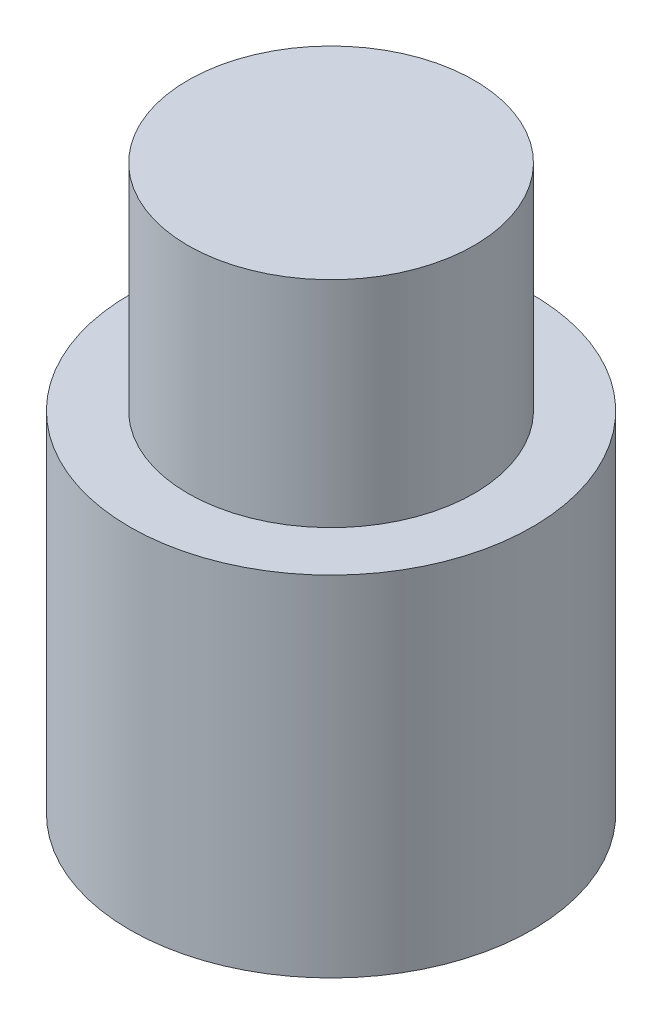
ISO-10303-21;
HEADER;
FILE_DESCRIPTION(('STEP AP214'),'2;1');
FILE_NAME('part.step','',(''),(''),'','','');
FILE_SCHEMA(('AUTOMOTIVE_DESIGN { 1 0 10303 214 1 1 1 1 }'));
ENDSEC;
DATA;
#1=APPLICATION_CONTEXT('core data for automotive mechanical design processes');
#2=APPLICATION_PROTOCOL_DEFINITION('international standard','automotive_design',2000,#1);
#3=PRODUCT_CONTEXT('',#1,'mechanical');
#4=PRODUCT('Part','Part','',(#3));
#5=PRODUCT_RELATED_PRODUCT_CATEGORY('part','',(#4));
#6=PRODUCT_DEFINITION_FORMATION('','',#4);
#7=PRODUCT_DEFINITION_CONTEXT('part definition',#1,'design');
#8=PRODUCT_DEFINITION('design','',#6,#7);
#9=PRODUCT_DEFINITION_SHAPE('','',#8);
#10=(LENGTH_UNIT() NAMED_UNIT(*) SI_UNIT(.MILLI.,.METRE.));
#11=(NAMED_UNIT(*) PLANE_ANGLE_UNIT() SI_UNIT($,.RADIAN.));
#12=(NAMED_UNIT(*) SI_UNIT($,.STERADIAN.) SOLID_ANGLE_UNIT());
#13=UNCERTAINTY_MEASURE_WITH_UNIT(LENGTH_MEASURE(1.E-05),#10,'distance_accuracy_value','');
#14=(GEOMETRIC_REPRESENTATION_CONTEXT(3) GLOBAL_UNCERTAINTY_ASSIGNED_CONTEXT((#13)) GLOBAL_UNIT_ASSIGNED_CONTEXT((#10,
#11,#12)) REPRESENTATION_CONTEXT('',''));
#15=CARTESIAN_POINT('',(0.,0.,0.));
#16=DIRECTION('',(0.,0.,1.));
#17=DIRECTION('',(1.,0.,0.));
#18=AXIS2_PLACEMENT_3D('',#15,#16,#17);
#19=CARTESIAN_POINT('',(0.,400.05,-203.2));
#20=DIRECTION('',(0.,-1.,0.));
#21=DIRECTION('',(0.,0.,-1.));
#22=AXIS2_PLACEMENT_3D('',#19,#20,#21);
#23=PLANE('',#22);
#24=CARTESIAN_POINT('',(0.,400.05,0.));
#25=DIRECTION('',(0.,1.,0.));
#26=DIRECTION('',(0.,0.,1.));
#27=AXIS2_PLACEMENT_3D('',#24,#25,#26);
#28=CIRCLE('',#27,203.2);
#29=CARTESIAN_POINT('',(0.,400.05,203.2));
#30=VERTEX_POINT('',#29);
#31=EDGE_CURVE('E10',#30,#30,#28,.T.);
#32=ORIENTED_EDGE('',*,*,#31,.T.);
#33=EDGE_LOOP('',(#32));
#34=FACE_BOUND('',#33,.T.);
#35=ADVANCED_FACE('F31',(#34),#23,.F.);
#36=CARTESIAN_POINT('',(0.,345.622216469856,0.));
#37=DIRECTION('',(0.,1.,0.));
#38=DIRECTION('',(0.,0.,1.));
#39=AXIS2_PLACEMENT_3D('',#36,#37,#38);
#40=CYLINDRICAL_SURFACE('',#39,203.2);
#41=ORIENTED_EDGE('',*,*,#31,.F.);
#42=EDGE_LOOP('',(#41));
#43=FACE_BOUND('',#42,.T.);
#44=CARTESIAN_POINT('',(0.,95.2499999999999,0.));
#45=DIRECTION('',(0.,1.,0.));
#46=DIRECTION('',(0.,0.,1.));
#47=AXIS2_PLACEMENT_3D('',#44,#45,#46);
#48=CIRCLE('',#47,203.2);
#49=CARTESIAN_POINT('',(0.,95.2499999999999,203.2));
#50=VERTEX_POINT('',#49);
#51=EDGE_CURVE('E37',#50,#50,#48,.T.);
#52=ORIENTED_EDGE('',*,*,#51,.T.);
#53=EDGE_LOOP('',(#52));
#54=FACE_BOUND('',#53,.T.);
#55=ADVANCED_FACE('F63',(#43,#54),#40,.T.);
#56=CARTESIAN_POINT('',(0.,95.2499999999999,-285.75));
#57=DIRECTION('',(0.,-1.,0.));
#58=DIRECTION('',(0.,0.,-1.));
#59=AXIS2_PLACEMENT_3D('',#56,#57,#58);
#60=PLANE('',#59);
#61=ORIENTED_EDGE('',*,*,#51,.F.);
#62=EDGE_LOOP('',(#61));
#63=FACE_BOUND('',#62,.T.);
#64=CARTESIAN_POINT('',(0.,95.2499999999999,0.));
#65=DIRECTION('',(0.,1.,0.));
#66=DIRECTION('',(0.,0.,1.));
#67=AXIS2_PLACEMENT_3D('',#64,#65,#66);
#68=CIRCLE('',#67,285.75);
#69=CARTESIAN_POINT('',(0.,95.2499999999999,285.75));
#70=VERTEX_POINT('',#69);
#71=EDGE_CURVE('E41',#70,#70,#68,.T.);
#72=ORIENTED_EDGE('',*,*,#71,.T.);
#73=EDGE_LOOP('',(#72));
#74=FACE_BOUND('',#73,.T.);
#75=ADVANCED_FACE('F59',(#63,#74),#60,.F.);
#76=CARTESIAN_POINT('',(0.,345.622216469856,0.));
#77=DIRECTION('',(0.,1.,0.));
#78=DIRECTION('',(0.,0.,1.));
#79=AXIS2_PLACEMENT_3D('',#76,#77,#78);
#80=CYLINDRICAL_SURFACE('',#79,285.75);
#81=ORIENTED_EDGE('',*,*,#71,.F.);
#82=EDGE_LOOP('',(#81));
#83=FACE_BOUND('',#82,.T.);
#84=CARTESIAN_POINT('',(0.,-400.05,0.));
#85=DIRECTION('',(0.,1.,0.));
#86=DIRECTION('',(0.,0.,1.));
#87=AXIS2_PLACEMENT_3D('',#84,#85,#86);
#88=CIRCLE('',#87,285.75);
#89=CARTESIAN_POINT('',(0.,-400.05,285.75));
#90=VERTEX_POINT('',#89);
#91=EDGE_CURVE('E45',#90,#90,#88,.T.);
#92=ORIENTED_EDGE('',*,*,#91,.T.);
#93=EDGE_LOOP('',(#92));
#94=FACE_BOUND('',#93,.T.);
#95=ADVANCED_FACE('F51',(#83,#94),#80,.T.);
#96=CARTESIAN_POINT('',(0.,-400.05,-203.2));
#97=DIRECTION('',(0.,1.,0.));
#98=DIRECTION('',(0.,0.,1.));
#99=AXIS2_PLACEMENT_3D('',#96,#97,#98);
#100=PLANE('',#99);
#101=ORIENTED_EDGE('',*,*,#91,.F.);
#102=EDGE_LOOP('',(#101));
#103=FACE_BOUND('',#102,.T.);
#104=ADVANCED_FACE('F53',(#103),#100,.F.);
#105=CLOSED_SHELL('',(#35,#55,#75,#95,#104));
#106=MANIFOLD_SOLID_BREP('B2',#105);
#107=ADVANCED_BREP_SHAPE_REPRESENTATION('',(#18,#106),#14);
#108=SHAPE_DEFINITION_REPRESENTATION(#9,#107);
ENDSEC;
END-ISO-10303-21;
